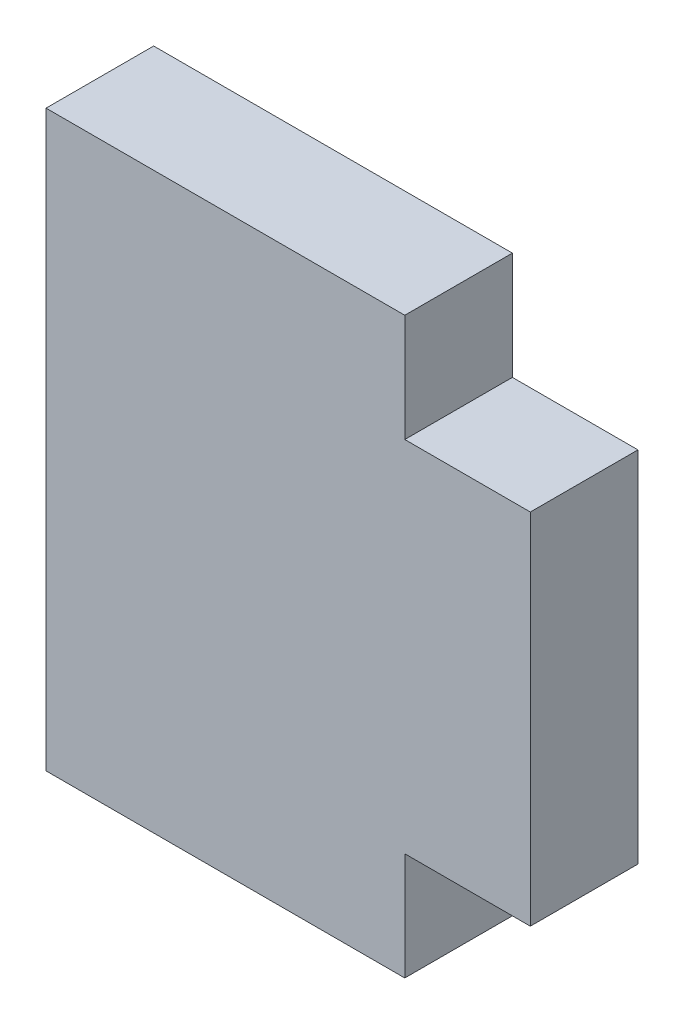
from build123d import *

# Parameters (mm, degrees)
BOSS_EXTRUDE1_DEPTH = 6


with BuildPart() as part:
    # Sketch1 → Boss-Extrude1 (new body)
    with BuildSketch(Plane.XY):
        Polygon((-305.028662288, 211.342156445), (-305.028662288, 217.342156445), (-298.028662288, 217.342156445), (-298.028662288, 237.342156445), (-305.028662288, 237.342156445), (-305.028662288, 243.342156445), (-325.028662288, 243.342156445), (-325.028662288, 237.342156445), (-325.028662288, 211.342156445), align=None)
    extrude(amount=BOSS_EXTRUDE1_DEPTH)


solid = part.part
